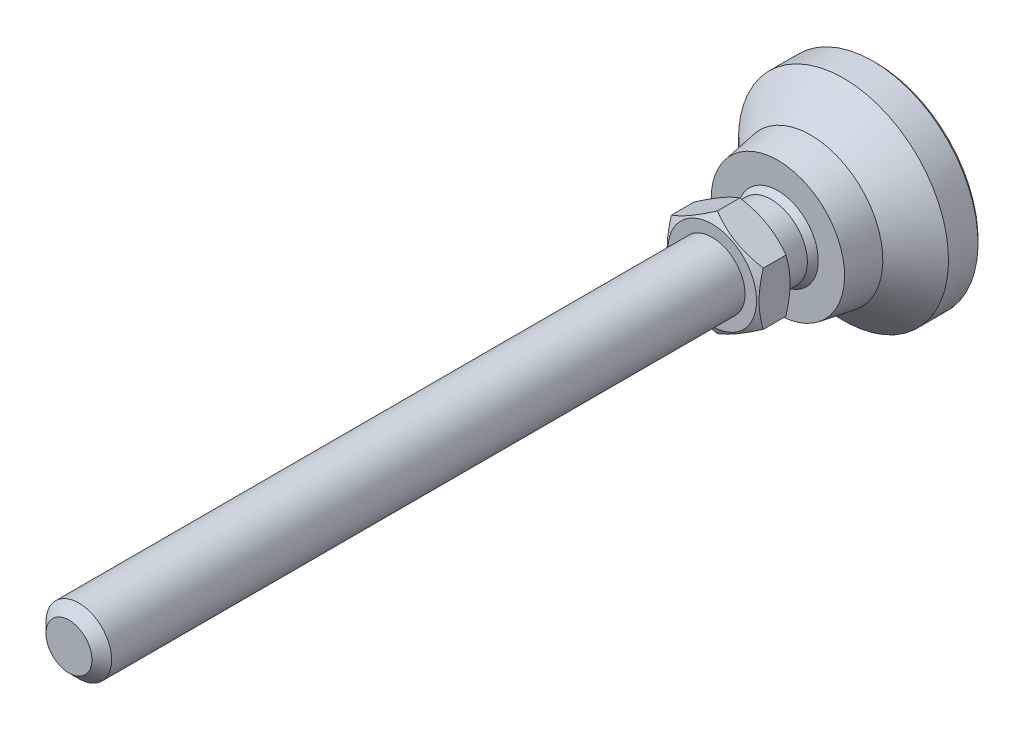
ISO-10303-21;
HEADER;
FILE_DESCRIPTION(('STEP AP214'),'2;1');
FILE_NAME('part.step','',(''),(''),'','','');
FILE_SCHEMA(('AUTOMOTIVE_DESIGN { 1 0 10303 214 1 1 1 1 }'));
ENDSEC;
DATA;
#1=APPLICATION_CONTEXT('core data for automotive mechanical design processes');
#2=APPLICATION_PROTOCOL_DEFINITION('international standard','automotive_design',2000,#1);
#3=PRODUCT_CONTEXT('',#1,'mechanical');
#4=PRODUCT('Part','Part','',(#3));
#5=PRODUCT_RELATED_PRODUCT_CATEGORY('part','',(#4));
#6=PRODUCT_DEFINITION_FORMATION('','',#4);
#7=PRODUCT_DEFINITION_CONTEXT('part definition',#1,'design');
#8=PRODUCT_DEFINITION('design','',#6,#7);
#9=PRODUCT_DEFINITION_SHAPE('','',#8);
#10=(LENGTH_UNIT() NAMED_UNIT(*) SI_UNIT(.MILLI.,.METRE.));
#11=(NAMED_UNIT(*) PLANE_ANGLE_UNIT() SI_UNIT($,.RADIAN.));
#12=(NAMED_UNIT(*) SI_UNIT($,.STERADIAN.) SOLID_ANGLE_UNIT());
#13=UNCERTAINTY_MEASURE_WITH_UNIT(LENGTH_MEASURE(1.E-05),#10,'distance_accuracy_value','');
#14=(GEOMETRIC_REPRESENTATION_CONTEXT(3) GLOBAL_UNCERTAINTY_ASSIGNED_CONTEXT((#13)) GLOBAL_UNIT_ASSIGNED_CONTEXT((#10,
#11,#12)) REPRESENTATION_CONTEXT('',''));
#15=CARTESIAN_POINT('',(0.,0.,0.));
#16=DIRECTION('',(0.,0.,1.));
#17=DIRECTION('',(1.,0.,0.));
#18=AXIS2_PLACEMENT_3D('',#15,#16,#17);
#19=CARTESIAN_POINT('',(0.,0.,0.));
#20=DIRECTION('',(0.,0.,-1.));
#21=DIRECTION('',(0.,1.,0.));
#22=AXIS2_PLACEMENT_3D('',#19,#20,#21);
#23=CYLINDRICAL_SURFACE('',#22,5.49999999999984);
#24=CARTESIAN_POINT('',(0.,0.,20.));
#25=DIRECTION('',(0.,0.,-1.));
#26=DIRECTION('',(0.,1.,0.));
#27=AXIS2_PLACEMENT_3D('',#24,#25,#26);
#28=CIRCLE('',#27,5.49999999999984);
#29=CARTESIAN_POINT('',(0.,5.49999999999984,20.));
#30=VERTEX_POINT('',#29);
#31=EDGE_CURVE('E112',#30,#30,#28,.T.);
#32=ORIENTED_EDGE('',*,*,#31,.T.);
#33=EDGE_LOOP('',(#32));
#34=FACE_BOUND('',#33,.T.);
#35=CARTESIAN_POINT('',(0.,0.,16.0000000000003));
#36=DIRECTION('',(0.,0.,1.));
#37=DIRECTION('',(0.,-1.,0.));
#38=AXIS2_PLACEMENT_3D('',#35,#36,#37);
#39=CIRCLE('',#38,5.49999999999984);
#40=CARTESIAN_POINT('',(-5.49999999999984,0.,16.0000000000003));
#41=VERTEX_POINT('',#40);
#42=EDGE_CURVE('E115',#41,#41,#39,.T.);
#43=ORIENTED_EDGE('',*,*,#42,.T.);
#44=EDGE_LOOP('',(#43));
#45=FACE_BOUND('',#44,.T.);
#46=ADVANCED_FACE('F14',(#34,#45),#23,.T.);
#47=CARTESIAN_POINT('',(0.,0.,11.6698729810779));
#48=DIRECTION('',(0.,0.,1.));
#49=DIRECTION('',(-1.,0.,0.));
#50=AXIS2_PLACEMENT_3D('',#47,#48,#49);
#51=SPHERICAL_SURFACE('',#50,7.);
#52=CARTESIAN_POINT('',(0.,0.,15.));
#53=DIRECTION('',(0.,0.,1.));
#54=DIRECTION('',(0.,-1.,0.));
#55=AXIS2_PLACEMENT_3D('',#52,#53,#54);
#56=CIRCLE('',#55,6.15713034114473);
#57=CARTESIAN_POINT('',(-6.15713034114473,0.,15.));
#58=VERTEX_POINT('',#57);
#59=EDGE_CURVE('E276',#58,#58,#56,.T.);
#60=CARTESIAN_POINT('',(-5.49999999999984,0.,16.0000000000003));
#61=CARTESIAN_POINT('',(-5.50771979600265,0.,15.9901945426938));
#62=CARTESIAN_POINT('',(-5.51541336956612,0.,15.9803684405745));
#63=CARTESIAN_POINT('',(-5.53074785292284,0.,15.9606752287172));
#64=CARTESIAN_POINT('',(-5.53838876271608,0.,15.9508081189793));
#65=CARTESIAN_POINT('',(-5.55361769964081,0.,15.9310331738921));
#66=CARTESIAN_POINT('',(-5.56120572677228,0.,15.9211253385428));
#67=CARTESIAN_POINT('',(-5.57632868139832,0.,15.9012692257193));
#68=CARTESIAN_POINT('',(-5.58386360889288,0.,15.8913209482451));
#69=CARTESIAN_POINT('',(-5.59888014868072,0.,15.871384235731));
#70=CARTESIAN_POINT('',(-5.60636176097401,0.,15.8613958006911));
#71=CARTESIAN_POINT('',(-5.62127145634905,0.,15.841379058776));
#72=CARTESIAN_POINT('',(-5.62869953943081,0.,15.8313507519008));
#73=CARTESIAN_POINT('',(-5.64350196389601,0.,15.81125455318));
#74=CARTESIAN_POINT('',(-5.65087630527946,0.,15.8011866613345));
#75=CARTESIAN_POINT('',(-5.66557103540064,0.,15.781011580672));
#76=CARTESIAN_POINT('',(-5.67289142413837,0.,15.770904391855));
#77=CARTESIAN_POINT('',(-5.68747803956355,0.,15.7506510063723));
#78=CARTESIAN_POINT('',(-5.69474426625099,0.,15.7405048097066));
#79=CARTESIAN_POINT('',(-5.70922234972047,0.,15.7201736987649));
#80=CARTESIAN_POINT('',(-5.7164342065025,0.,15.7099887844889));
#81=CARTESIAN_POINT('',(-5.7308033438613,0.,15.6895805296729));
#82=CARTESIAN_POINT('',(-5.73796062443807,0.,15.6793571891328));
#83=CARTESIAN_POINT('',(-5.75222040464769,0.,15.6588723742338));
#84=CARTESIAN_POINT('',(-5.75932290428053,0.,15.6486108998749));
#85=CARTESIAN_POINT('',(-5.77347291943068,0.,15.6280501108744));
#86=CARTESIAN_POINT('',(-5.78052043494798,0.,15.6177507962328));
#87=CARTESIAN_POINT('',(-5.79456028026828,0.,15.5971146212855));
#88=CARTESIAN_POINT('',(-5.80155261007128,0.,15.5867777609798));
#89=CARTESIAN_POINT('',(-5.81548188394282,0.,15.5660667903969));
#90=CARTESIAN_POINT('',(-5.82241882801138,0.,15.5556926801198));
#91=CARTESIAN_POINT('',(-5.83623713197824,0.,15.5349075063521));
#92=CARTESIAN_POINT('',(-5.84311849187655,0.,15.5244964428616));
#93=CARTESIAN_POINT('',(-5.85682543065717,0.,15.5036376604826));
#94=CARTESIAN_POINT('',(-5.86365100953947,0.,15.493189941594));
#95=CARTESIAN_POINT('',(-5.87724619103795,0.,15.4722581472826));
#96=CARTESIAN_POINT('',(-5.88401579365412,0.,15.4617740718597));
#97=CARTESIAN_POINT('',(-5.89749882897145,0.,15.4407698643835));
#98=CARTESIAN_POINT('',(-5.90421226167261,0.,15.4302497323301));
#99=CARTESIAN_POINT('',(-5.91758276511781,0.,15.4091737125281));
#100=CARTESIAN_POINT('',(-5.92423983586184,0.,15.3986178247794));
#101=CARTESIAN_POINT('',(-5.93749742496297,0.,15.3774705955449));
#102=CARTESIAN_POINT('',(-5.94409794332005,0.,15.366879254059));
#103=CARTESIAN_POINT('',(-5.95724223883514,0.,15.3456614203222));
#104=CARTESIAN_POINT('',(-5.96378601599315,0.,15.3350349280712));
#105=CARTESIAN_POINT('',(-5.9768166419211,0.,15.313747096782));
#106=CARTESIAN_POINT('',(-5.98330349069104,0.,15.3030857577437));
#107=CARTESIAN_POINT('',(-5.99622007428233,0.,15.2817285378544));
#108=CARTESIAN_POINT('',(-6.00264980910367,0.,15.2710326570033));
#109=CARTESIAN_POINT('',(-6.015451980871,0.,15.2496066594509));
#110=CARTESIAN_POINT('',(-6.02182441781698,0.,15.2388765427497));
#111=CARTESIAN_POINT('',(-6.034511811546,0.,15.217382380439));
#112=CARTESIAN_POINT('',(-6.04082676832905,0.,15.2066183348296));
#113=CARTESIAN_POINT('',(-6.05339902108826,0.,15.1850566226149));
#114=CARTESIAN_POINT('',(-6.05965631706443,0.,15.1742589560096));
#115=CARTESIAN_POINT('',(-6.07211306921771,0.,15.1526303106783));
#116=CARTESIAN_POINT('',(-6.07831252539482,0.,15.1417993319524));
#117=CARTESIAN_POINT('',(-6.09065342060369,0.,15.1201043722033));
#118=CARTESIAN_POINT('',(-6.09679485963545,0.,15.1092403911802));
#119=CARTESIAN_POINT('',(-6.10901954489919,0.,15.0874797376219));
#120=CARTESIAN_POINT('',(-6.11510279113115,0.,15.0765830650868));
#121=CARTESIAN_POINT('',(-6.12721091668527,0.,15.054757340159));
#122=CARTESIAN_POINT('',(-6.13323579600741,0.,15.0438282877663));
#123=CARTESIAN_POINT('',(-6.14522701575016,0.,15.0219381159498));
#124=CARTESIAN_POINT('',(-6.15119335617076,0.,15.010976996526));
#125=CARTESIAN_POINT('',(-6.15713034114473,0.,15.));
#126=B_SPLINE_CURVE_WITH_KNOTS('',3,(#60,#61,#62,#63,#64,#65,#66,#67,#68,#69,#70,#71,#72,#73,
#74,#75,#76,#77,#78,#79,#80,#81,#82,#83,#84,#85,#86,#87,#88,#89,#90,#91,#92,#93,#94,#95,#96,#97,
#98,#99,#100,#101,#102,#103,#104,#105,#106,#107,#108,#109,#110,#111,#112,#113,#114,#115,#116,
#117,#118,#119,#120,#121,#122,#123,#124,#125),.UNSPECIFIED.,.F.,.F.,(4,2,2,2,2,2,2,2,2,2,2,2,2,
2,2,2,2,2,2,2,2,2,2,2,2,2,2,2,2,2,2,2,4),(0.,0.0374389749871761,0.0748779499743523,
0.112316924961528,0.149755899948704,0.18719487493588,0.224633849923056,0.26207282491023,
0.299511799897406,0.336950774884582,0.374389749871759,0.411828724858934,0.449267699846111,
0.486706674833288,0.524145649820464,0.56158462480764,0.599023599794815,0.636462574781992,
0.673901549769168,0.711340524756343,0.74877949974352,0.786218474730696,0.823657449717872,
0.861096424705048,0.898535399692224,0.9359743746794,0.973413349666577,1.01085232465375,
1.04829129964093,1.0857302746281,1.12316924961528,1.16060822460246,1.19804719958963),.UNSPECIFIED.);
#127=EDGE_CURVE('BSEAM243',#41,#58,#126,.T.);
#128=ORIENTED_EDGE('',*,*,#42,.F.);
#129=ORIENTED_EDGE('',*,*,#59,.T.);
#130=ORIENTED_EDGE('',*,*,#127,.T.);
#131=ORIENTED_EDGE('',*,*,#127,.F.);
#132=EDGE_LOOP('',(#128,#130,#129,#131));
#133=FACE_BOUND('',#132,.T.);
#134=ADVANCED_FACE('F243',(#133),#51,.T.);
#135=CARTESIAN_POINT('',(-15.5,0.,0.));
#136=DIRECTION('',(0.,0.,1.));
#137=DIRECTION('',(0.,-1.,0.));
#138=AXIS2_PLACEMENT_3D('',#135,#136,#137);
#139=PLANE('',#138);
#140=CARTESIAN_POINT('',(0.,0.,0.));
#141=DIRECTION('',(0.,0.,-1.));
#142=DIRECTION('',(0.,1.,0.));
#143=AXIS2_PLACEMENT_3D('',#140,#141,#142);
#144=CIRCLE('',#143,15.5);
#145=CARTESIAN_POINT('',(0.,15.5,0.));
#146=VERTEX_POINT('',#145);
#147=EDGE_CURVE('E85',#146,#146,#144,.T.);
#148=ORIENTED_EDGE('',*,*,#147,.T.);
#149=EDGE_LOOP('',(#148));
#150=FACE_BOUND('',#149,.T.);
#151=ADVANCED_FACE('F246',(#150),#139,.F.);
#152=CARTESIAN_POINT('',(0.,0.,0.500000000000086));
#153=DIRECTION('',(0.,0.,1.));
#154=DIRECTION('',(0.,-1.,0.));
#155=AXIS2_PLACEMENT_3D('',#152,#153,#154);
#156=CONICAL_SURFACE('',#155,16.,0.785398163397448);
#157=ORIENTED_EDGE('',*,*,#147,.F.);
#158=EDGE_LOOP('',(#157));
#159=FACE_BOUND('',#158,.T.);
#160=CARTESIAN_POINT('',(0.,0.,0.500000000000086));
#161=DIRECTION('',(0.,0.,-1.));
#162=DIRECTION('',(0.,1.,0.));
#163=AXIS2_PLACEMENT_3D('',#160,#161,#162);
#164=CIRCLE('',#163,16.);
#165=CARTESIAN_POINT('',(0.,16.,0.500000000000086));
#166=VERTEX_POINT('',#165);
#167=EDGE_CURVE('E88',#166,#166,#164,.T.);
#168=ORIENTED_EDGE('',*,*,#167,.T.);
#169=EDGE_LOOP('',(#168));
#170=FACE_BOUND('',#169,.T.);
#171=ADVANCED_FACE('F361',(#159,#170),#156,.T.);
#172=CARTESIAN_POINT('',(0.,0.,0.));
#173=DIRECTION('',(0.,0.,-1.));
#174=DIRECTION('',(0.,1.,0.));
#175=AXIS2_PLACEMENT_3D('',#172,#173,#174);
#176=CYLINDRICAL_SURFACE('',#175,16.);
#177=ORIENTED_EDGE('',*,*,#167,.F.);
#178=EDGE_LOOP('',(#177));
#179=FACE_BOUND('',#178,.T.);
#180=CARTESIAN_POINT('',(0.,0.,5.00000000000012));
#181=DIRECTION('',(0.,0.,-1.));
#182=DIRECTION('',(0.,1.,0.));
#183=AXIS2_PLACEMENT_3D('',#180,#181,#182);
#184=CIRCLE('',#183,16.);
#185=CARTESIAN_POINT('',(0.,16.,5.00000000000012));
#186=VERTEX_POINT('',#185);
#187=EDGE_CURVE('E105',#186,#186,#184,.T.);
#188=ORIENTED_EDGE('',*,*,#187,.T.);
#189=EDGE_LOOP('',(#188));
#190=FACE_BOUND('',#189,.T.);
#191=ADVANCED_FACE('F368',(#179,#190),#176,.T.);
#192=CARTESIAN_POINT('',(0.,0.,10.));
#193=DIRECTION('',(0.,0.,-1.));
#194=DIRECTION('',(0.,1.,0.));
#195=AXIS2_PLACEMENT_3D('',#192,#193,#194);
#196=CONICAL_SURFACE('',#195,11.,0.785398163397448);
#197=ORIENTED_EDGE('',*,*,#187,.F.);
#198=EDGE_LOOP('',(#197));
#199=FACE_BOUND('',#198,.T.);
#200=CARTESIAN_POINT('',(0.,0.,10.));
#201=DIRECTION('',(0.,0.,-1.));
#202=DIRECTION('',(0.,1.,0.));
#203=AXIS2_PLACEMENT_3D('',#200,#201,#202);
#204=CIRCLE('',#203,11.);
#205=CARTESIAN_POINT('',(0.,11.,10.));
#206=VERTEX_POINT('',#205);
#207=EDGE_CURVE('E108',#206,#206,#204,.T.);
#208=ORIENTED_EDGE('',*,*,#207,.T.);
#209=EDGE_LOOP('',(#208));
#210=FACE_BOUND('',#209,.T.);
#211=ADVANCED_FACE('F376',(#199,#210),#196,.T.);
#212=CARTESIAN_POINT('',(0.,0.,16.));
#213=DIRECTION('',(0.,0.,-1.));
#214=DIRECTION('',(0.,1.,0.));
#215=AXIS2_PLACEMENT_3D('',#212,#213,#214);
#216=CONICAL_SURFACE('',#215,10.,0.165148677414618);
#217=ORIENTED_EDGE('',*,*,#207,.F.);
#218=EDGE_LOOP('',(#217));
#219=FACE_BOUND('',#218,.T.);
#220=CARTESIAN_POINT('',(0.,0.,15.));
#221=DIRECTION('',(0.,0.,-1.));
#222=DIRECTION('',(0.,1.,0.));
#223=AXIS2_PLACEMENT_3D('',#220,#221,#222);
#224=CIRCLE('',#223,10.1666666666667);
#225=CARTESIAN_POINT('',(0.,10.1666666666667,15.));
#226=VERTEX_POINT('',#225);
#227=EDGE_CURVE('E93',#226,#226,#224,.T.);
#228=ORIENTED_EDGE('',*,*,#227,.T.);
#229=EDGE_LOOP('',(#228));
#230=FACE_BOUND('',#229,.T.);
#231=ADVANCED_FACE('F241',(#219,#230),#216,.T.);
#232=CARTESIAN_POINT('',(-10.1666666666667,0.,15.));
#233=DIRECTION('',(0.,0.,1.));
#234=DIRECTION('',(0.,-1.,0.));
#235=AXIS2_PLACEMENT_3D('',#232,#233,#234);
#236=PLANE('',#235);
#237=ORIENTED_EDGE('',*,*,#227,.F.);
#238=EDGE_LOOP('',(#237));
#239=FACE_BOUND('',#238,.T.);
#240=ORIENTED_EDGE('',*,*,#59,.F.);
#241=EDGE_LOOP('',(#240));
#242=FACE_BOUND('',#241,.T.);
#243=ADVANCED_FACE('F236',(#239,#242),#236,.T.);
#244=CARTESIAN_POINT('',(0.,-8.08290376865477,20.));
#245=DIRECTION('',(0.,0.,-1.));
#246=DIRECTION('',(0.,1.,0.));
#247=AXIS2_PLACEMENT_3D('',#244,#245,#246);
#248=PLANE('',#247);
#249=CARTESIAN_POINT('',(0.,0.,20.));
#250=DIRECTION('',(0.,0.,1.));
#251=DIRECTION('',(0.,-1.,0.));
#252=AXIS2_PLACEMENT_3D('',#249,#250,#251);
#253=CIRCLE('',#252,6.75);
#254=CARTESIAN_POINT('',(0.,-6.75,20.));
#255=VERTEX_POINT('',#254);
#256=EDGE_CURVE('E80',#255,#255,#253,.T.);
#257=ORIENTED_EDGE('',*,*,#256,.F.);
#258=EDGE_LOOP('',(#257));
#259=FACE_BOUND('',#258,.T.);
#260=ORIENTED_EDGE('',*,*,#31,.F.);
#261=EDGE_LOOP('',(#260));
#262=FACE_BOUND('',#261,.T.);
#263=ADVANCED_FACE('F240',(#259,#262),#248,.T.);
#264=CARTESIAN_POINT('',(0.,0.,20.));
#265=DIRECTION('',(0.,0.,1.));
#266=DIRECTION('',(0.,-1.,0.));
#267=AXIS2_PLACEMENT_3D('',#264,#265,#266);
#268=CONICAL_SURFACE('',#267,6.75,1.0471975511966);
#269=CARTESIAN_POINT('',(7.0002,-4.04133641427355,20.7696190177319));
#270=CARTESIAN_POINT('',(6.84633209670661,-4.13017208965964,20.7183374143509));
#271=CARTESIAN_POINT('',(6.69189049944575,-4.21933898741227,20.669383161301));
#272=CARTESIAN_POINT('',(6.38175307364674,-4.3983969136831,20.5767703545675));
#273=CARTESIAN_POINT('',(6.22605673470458,-4.4882882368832,20.5331140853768));
#274=CARTESIAN_POINT('',(5.75647483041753,-4.7594014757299,20.4109491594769));
#275=CARTESIAN_POINT('',(5.4407356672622,-4.94169356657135,20.3414631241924));
#276=CARTESIAN_POINT('',(4.96823775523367,-5.21449036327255,20.2599825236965));
#277=CARTESIAN_POINT('',(4.81289077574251,-5.30417998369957,20.2367710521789));
#278=CARTESIAN_POINT('',(4.50149488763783,-5.48396448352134,20.1978487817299));
#279=CARTESIAN_POINT('',(4.34544604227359,-5.57405932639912,20.1821373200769));
#280=CARTESIAN_POINT('',(4.03307732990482,-5.75440548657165,20.1586154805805));
#281=CARTESIAN_POINT('',(3.87675797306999,-5.84465650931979,20.1507961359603));
#282=CARTESIAN_POINT('',(3.56398349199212,-6.02523694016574,20.1432178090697));
#283=CARTESIAN_POINT('',(3.40752837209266,-6.11556634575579,20.1434585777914));
#284=CARTESIAN_POINT('',(2.97889312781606,-6.36303901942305,20.155197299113));
#285=CARTESIAN_POINT('',(2.7068533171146,-6.52010127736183,20.1749033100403));
#286=CARTESIAN_POINT('',(2.1645805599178,-6.8331825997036,20.2373910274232));
#287=CARTESIAN_POINT('',(1.89434952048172,-6.98920056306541,20.2801940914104));
#288=CARTESIAN_POINT('',(1.35098545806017,-7.30291195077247,20.3871892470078));
#289=CARTESIAN_POINT('',(1.07792099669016,-7.46056579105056,20.4518346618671));
#290=CARTESIAN_POINT('',(0.535864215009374,-7.77352241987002,20.5985536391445));
#291=CARTESIAN_POINT('',(0.266864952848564,-7.92882921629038,20.680592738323));
#292=CARTESIAN_POINT('',(-0.000199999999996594,-8.08301923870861,20.7696190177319));
#293=B_SPLINE_CURVE_WITH_KNOTS('',3,(#269,#270,#271,#272,#273,#274,#275,#276,#277,#278,#279,
#280,#281,#282,#283,#284,#285,#286,#287,#288,#289,#290,#291,#292),.UNSPECIFIED.,.F.,.F.,(4,2,2,
2,2,2,2,2,2,2,2,4),(0.,0.554727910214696,1.10969417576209,2.2219327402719,2.76443041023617,
3.30688013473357,3.8487128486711,4.39052882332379,5.33376515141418,6.27787517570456,
7.24292418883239,8.20607866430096),.UNSPECIFIED.);
#294=CARTESIAN_POINT('',(7.,-4.04145188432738,20.7695523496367));
#295=VERTEX_POINT('',#294);
#296=CARTESIAN_POINT('',(0.,-8.08290376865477,20.7695523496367));
#297=VERTEX_POINT('',#296);
#298=EDGE_CURVE('E33',#295,#297,#293,.T.);
#299=ORIENTED_EDGE('',*,*,#298,.T.);
#300=CARTESIAN_POINT('',(0.000200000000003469,-8.0830192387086,20.7696190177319));
#301=CARTESIAN_POINT('',(-0.153667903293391,-7.99418356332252,20.7183374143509));
#302=CARTESIAN_POINT('',(-0.30810950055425,-7.90501666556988,20.669383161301));
#303=CARTESIAN_POINT('',(-0.618246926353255,-7.72595873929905,20.5767703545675));
#304=CARTESIAN_POINT('',(-0.773943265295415,-7.63606741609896,20.5331140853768));
#305=CARTESIAN_POINT('',(-1.24352516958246,-7.36495417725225,20.4109491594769));
#306=CARTESIAN_POINT('',(-1.5592643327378,-7.18266208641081,20.3414631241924));
#307=CARTESIAN_POINT('',(-2.03176224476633,-6.90986528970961,20.2599825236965));
#308=CARTESIAN_POINT('',(-2.18710922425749,-6.82017566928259,20.2367710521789));
#309=CARTESIAN_POINT('',(-2.49850511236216,-6.64039116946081,20.1978487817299));
#310=CARTESIAN_POINT('',(-2.65455395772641,-6.55029632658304,20.1821373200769));
#311=CARTESIAN_POINT('',(-2.96692267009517,-6.36995016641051,20.1586154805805));
#312=CARTESIAN_POINT('',(-3.12324202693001,-6.27969914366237,20.1507961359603));
#313=CARTESIAN_POINT('',(-3.43601650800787,-6.09911871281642,20.1432178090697));
#314=CARTESIAN_POINT('',(-3.59247162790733,-6.00878930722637,20.1434585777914));
#315=CARTESIAN_POINT('',(-4.02110687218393,-5.76131663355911,20.155197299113));
#316=CARTESIAN_POINT('',(-4.2931466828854,-5.60425437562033,20.1749033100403));
#317=CARTESIAN_POINT('',(-4.8354194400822,-5.29117305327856,20.2373910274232));
#318=CARTESIAN_POINT('',(-5.10565047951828,-5.13515508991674,20.2801940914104));
#319=CARTESIAN_POINT('',(-5.64901454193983,-4.82144370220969,20.3871892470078));
#320=CARTESIAN_POINT('',(-5.92207900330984,-4.6637898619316,20.4518346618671));
#321=CARTESIAN_POINT('',(-6.46413578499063,-4.35083323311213,20.5985536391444));
#322=CARTESIAN_POINT('',(-6.73313504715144,-4.19552643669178,20.680592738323));
#323=CARTESIAN_POINT('',(-7.0002,-4.04133641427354,20.7696190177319));
#324=B_SPLINE_CURVE_WITH_KNOTS('',3,(#300,#301,#302,#303,#304,#305,#306,#307,#308,#309,#310,
#311,#312,#313,#314,#315,#316,#317,#318,#319,#320,#321,#322,#323),.UNSPECIFIED.,.F.,.F.,(4,2,2,
2,2,2,2,2,2,2,2,4),(0.,0.554727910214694,1.10969417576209,2.2219327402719,2.76443041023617,
3.30688013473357,3.8487128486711,4.39052882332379,5.33376515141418,6.27787517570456,
7.2429241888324,8.20607866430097),.UNSPECIFIED.);
#325=CARTESIAN_POINT('',(-7.,-4.04145188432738,20.7695523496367));
#326=VERTEX_POINT('',#325);
#327=EDGE_CURVE('E9',#297,#326,#324,.T.);
#328=ORIENTED_EDGE('',*,*,#327,.T.);
#329=CARTESIAN_POINT('',(-7.,10.8702835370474,23.5675371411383));
#330=CARTESIAN_POINT('',(-7.,10.5644253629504,23.4191104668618));
#331=CARTESIAN_POINT('',(-7.,10.2578666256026,23.2721027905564));
#332=CARTESIAN_POINT('',(-7.,9.64297550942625,22.9817232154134));
#333=CARTESIAN_POINT('',(-7.,9.33464286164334,22.8383518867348));
#334=CARTESIAN_POINT('',(-7.,8.7142497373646,22.5553245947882));
#335=CARTESIAN_POINT('',(-7.,8.40217811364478,22.4156929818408));
#336=CARTESIAN_POINT('',(-7.,7.77555786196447,22.1421246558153));
#337=CARTESIAN_POINT('',(-7.,7.46100935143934,22.0081876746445));
#338=CARTESIAN_POINT('',(-7.,6.81872733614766,21.743301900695));
#339=CARTESIAN_POINT('',(-7.,6.49089596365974,21.6125891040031));
#340=CARTESIAN_POINT('',(-7.,5.83140395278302,21.3610213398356));
#341=CARTESIAN_POINT('',(-7.,5.49974289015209,21.240167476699));
#342=CARTESIAN_POINT('',(-7.,4.83267592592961,21.0114799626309));
#343=CARTESIAN_POINT('',(-7.,4.49727911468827,20.9036200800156));
#344=CARTESIAN_POINT('',(-7.,3.82168635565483,20.7043706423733));
#345=CARTESIAN_POINT('',(-7.,3.48149195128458,20.6129759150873));
#346=CARTESIAN_POINT('',(-7.,2.7979450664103,20.4515260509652));
#347=CARTESIAN_POINT('',(-7.,2.45462079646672,20.3813546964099));
#348=CARTESIAN_POINT('',(-7.,1.93649600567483,20.295045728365));
#349=CARTESIAN_POINT('',(-7.,1.7632518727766,20.2694329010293));
#350=CARTESIAN_POINT('',(-7.,1.41589837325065,20.2250254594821));
#351=CARTESIAN_POINT('',(-7.,1.24178909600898,20.2062301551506));
#352=CARTESIAN_POINT('',(-7.,0.895218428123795,20.17606851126));
#353=CARTESIAN_POINT('',(-7.,0.722765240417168,20.1646082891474));
#354=CARTESIAN_POINT('',(-7.,0.377528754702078,20.1489915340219));
#355=CARTESIAN_POINT('',(-7.,0.204745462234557,20.1448348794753));
#356=CARTESIAN_POINT('',(-7.,-0.140842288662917,20.1439244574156));
#357=CARTESIAN_POINT('',(-7.,-0.313646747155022,20.1471707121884));
#358=CARTESIAN_POINT('',(-7.,-0.658964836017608,20.1609865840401));
#359=CARTESIAN_POINT('',(-7.,-0.831478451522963,20.1715565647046));
#360=CARTESIAN_POINT('',(-7.,-1.24563895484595,20.205499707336));
#361=CARTESIAN_POINT('',(-7.,-1.48700907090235,20.2323231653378));
#362=CARTESIAN_POINT('',(-7.,-1.96795604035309,20.2988467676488));
#363=CARTESIAN_POINT('',(-7.,-2.20753264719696,20.3385486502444));
#364=CARTESIAN_POINT('',(-7.,-2.9232991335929,20.4748665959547));
#365=CARTESIAN_POINT('',(-7.,-3.39625884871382,20.5886701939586));
#366=CARTESIAN_POINT('',(-7.,-4.10348368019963,20.7859997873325));
#367=CARTESIAN_POINT('',(-7.,-4.34141737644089,20.8571337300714));
#368=CARTESIAN_POINT('',(-7.,-4.81497377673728,21.0067861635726));
#369=CARTESIAN_POINT('',(-7.,-5.05059646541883,21.0853047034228));
#370=CARTESIAN_POINT('',(-7.,-5.51960507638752,21.2484668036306));
#371=CARTESIAN_POINT('',(-7.,-5.75299170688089,21.3331083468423));
#372=CARTESIAN_POINT('',(-7.,-6.21783145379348,21.5075209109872));
#373=CARTESIAN_POINT('',(-7.,-6.4492845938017,21.5972918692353));
#374=CARTESIAN_POINT('',(-7.,-6.9992643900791,21.8165019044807));
#375=CARTESIAN_POINT('',(-7.,-7.31700619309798,21.9479065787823));
#376=CARTESIAN_POINT('',(-7.,-7.949756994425,22.217157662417));
#377=CARTESIAN_POINT('',(-7.,-8.26476581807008,22.35500447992));
#378=CARTESIAN_POINT('',(-7.,-8.89255914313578,22.6358336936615));
#379=CARTESIAN_POINT('',(-7.,-9.2053431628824,22.7788171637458));
#380=CARTESIAN_POINT('',(-7.,-9.82900890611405,23.068881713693));
#381=CARTESIAN_POINT('',(-7.,-10.1398905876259,23.215962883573));
#382=CARTESIAN_POINT('',(-7.,-10.7604003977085,23.513606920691));
#383=CARTESIAN_POINT('',(-7.,-11.0700267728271,23.6641734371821));
#384=CARTESIAN_POINT('',(-7.,-11.6879384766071,23.9680360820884));
#385=CARTESIAN_POINT('',(-7.,-11.9962237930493,24.1213322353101));
#386=CARTESIAN_POINT('',(-7.,-12.9193064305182,24.5845405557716));
#387=CARTESIAN_POINT('',(-7.,-13.5324166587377,24.8978142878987));
#388=CARTESIAN_POINT('',(-7.,-14.7033521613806,25.5037261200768));
#389=CARTESIAN_POINT('',(-7.,-15.2614434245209,25.7958525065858));
#390=CARTESIAN_POINT('',(-7.,-16.375558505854,26.3840679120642));
#391=CARTESIAN_POINT('',(-7.,-16.9315822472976,26.6801570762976));
#392=CARTESIAN_POINT('',(-7.,-18.0406029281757,27.2745892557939));
#393=CARTESIAN_POINT('',(-7.,-18.5936039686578,27.5729246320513));
#394=CARTESIAN_POINT('',(-7.,-19.6982866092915,28.171955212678));
#395=CARTESIAN_POINT('',(-7.,-20.2499682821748,28.4726502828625));
#396=CARTESIAN_POINT('',(-7.,-20.8011656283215,28.7742246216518));
#397=B_SPLINE_CURVE_WITH_KNOTS('',3,(#329,#330,#331,#332,#333,#334,#335,#336,#337,#338,#339,
#340,#341,#342,#343,#344,#345,#346,#347,#348,#349,#350,#351,#352,#353,#354,#355,#356,#357,#358,
#359,#360,#361,#362,#363,#364,#365,#366,#367,#368,#369,#370,#371,#372,#373,#374,#375,#376,#377,
#378,#379,#380,#381,#382,#383,#384,#385,#386,#387,#388,#389,#390,#391,#392,#393,#394,#395,#396),
.UNSPECIFIED.,.F.,.F.,(4,2,2,2,2,2,2,2,2,2,2,2,2,2,2,2,2,2,2,2,2,2,2,2,2,2,2,2,2,2,2,2,2,4),(0.,
1.01992281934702,2.04000458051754,3.06561543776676,4.09117795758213,5.14984345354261,
6.20862737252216,7.26523671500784,8.3215135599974,9.37189697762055,9.89716564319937,
10.4223811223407,10.9407322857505,11.4590748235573,11.9774189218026,12.4957887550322,
13.2239455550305,13.9522006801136,15.4095112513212,16.154467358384,16.8994284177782,
17.6441451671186,18.3888528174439,19.4202812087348,20.4517750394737,21.4834857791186,
22.5152192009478,23.5480866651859,24.5809635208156,26.6464299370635,28.5361836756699,
30.4260068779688,32.3110279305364,34.1959425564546),.UNSPECIFIED.);
#398=CARTESIAN_POINT('',(-7.,4.04145188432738,20.7695523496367));
#399=VERTEX_POINT('',#398);
#400=EDGE_CURVE('E72',#326,#399,#397,.F.);
#401=ORIENTED_EDGE('',*,*,#400,.T.);
#402=CARTESIAN_POINT('',(-7.0002,4.04133641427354,20.7696190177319));
#403=CARTESIAN_POINT('',(-6.84633209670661,4.13017208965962,20.7183374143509));
#404=CARTESIAN_POINT('',(-6.69189049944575,4.21933898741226,20.669383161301));
#405=CARTESIAN_POINT('',(-6.38175307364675,4.39839691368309,20.5767703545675));
#406=CARTESIAN_POINT('',(-6.22605673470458,4.48828823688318,20.5331140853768));
#407=CARTESIAN_POINT('',(-5.75647483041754,4.75940147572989,20.4109491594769));
#408=CARTESIAN_POINT('',(-5.4407356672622,4.94169356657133,20.3414631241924));
#409=CARTESIAN_POINT('',(-4.96823775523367,5.21449036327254,20.2599825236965));
#410=CARTESIAN_POINT('',(-4.81289077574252,5.30417998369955,20.2367710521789));
#411=CARTESIAN_POINT('',(-4.50149488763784,5.48396448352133,20.1978487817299));
#412=CARTESIAN_POINT('',(-4.34544604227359,5.57405932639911,20.1821373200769));
#413=CARTESIAN_POINT('',(-4.03307732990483,5.75440548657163,20.1586154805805));
#414=CARTESIAN_POINT('',(-3.87675797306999,5.84465650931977,20.1507961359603));
#415=CARTESIAN_POINT('',(-3.56398349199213,6.02523694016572,20.1432178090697));
#416=CARTESIAN_POINT('',(-3.40752837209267,6.11556634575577,20.1434585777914));
#417=CARTESIAN_POINT('',(-2.97889312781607,6.36303901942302,20.155197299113));
#418=CARTESIAN_POINT('',(-2.7068533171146,6.52010127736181,20.1749033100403));
#419=CARTESIAN_POINT('',(-2.16458055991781,6.83318259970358,20.2373910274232));
#420=CARTESIAN_POINT('',(-1.89434952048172,6.9892005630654,20.2801940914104));
#421=CARTESIAN_POINT('',(-1.35098545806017,7.30291195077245,20.3871892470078));
#422=CARTESIAN_POINT('',(-1.07792099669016,7.46056579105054,20.4518346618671));
#423=CARTESIAN_POINT('',(-0.535864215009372,7.77352241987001,20.5985536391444));
#424=CARTESIAN_POINT('',(-0.266864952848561,7.92882921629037,20.680592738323));
#425=CARTESIAN_POINT('',(0.000199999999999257,8.0830192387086,20.7696190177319));
#426=B_SPLINE_CURVE_WITH_KNOTS('',3,(#402,#403,#404,#405,#406,#407,#408,#409,#410,#411,#412,
#413,#414,#415,#416,#417,#418,#419,#420,#421,#422,#423,#424,#425),.UNSPECIFIED.,.F.,.F.,(4,2,2,
2,2,2,2,2,2,2,2,4),(0.,0.554727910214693,1.10969417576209,2.2219327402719,2.76443041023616,
3.30688013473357,3.84871284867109,4.39052882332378,5.33376515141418,6.27787517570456,
7.2429241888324,8.20607866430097),.UNSPECIFIED.);
#427=CARTESIAN_POINT('',(0.,8.08290376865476,20.7695523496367));
#428=VERTEX_POINT('',#427);
#429=EDGE_CURVE('E79',#399,#428,#426,.T.);
#430=ORIENTED_EDGE('',*,*,#429,.T.);
#431=CARTESIAN_POINT('',(-0.000200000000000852,8.0830192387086,20.7696190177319));
#432=CARTESIAN_POINT('',(0.15366790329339,7.99418356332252,20.7183374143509));
#433=CARTESIAN_POINT('',(0.308109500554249,7.90501666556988,20.669383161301));
#434=CARTESIAN_POINT('',(0.618246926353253,7.72595873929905,20.5767703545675));
#435=CARTESIAN_POINT('',(0.773943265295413,7.63606741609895,20.5331140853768));
#436=CARTESIAN_POINT('',(1.24352516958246,7.36495417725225,20.4109491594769));
#437=CARTESIAN_POINT('',(1.5592643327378,7.18266208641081,20.3414631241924));
#438=CARTESIAN_POINT('',(2.03176224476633,6.9098652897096,20.2599825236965));
#439=CARTESIAN_POINT('',(2.18710922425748,6.82017566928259,20.2367710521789));
#440=CARTESIAN_POINT('',(2.49850511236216,6.64039116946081,20.1978487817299));
#441=CARTESIAN_POINT('',(2.65455395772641,6.55029632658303,20.1821373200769));
#442=CARTESIAN_POINT('',(2.96692267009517,6.36995016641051,20.1586154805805));
#443=CARTESIAN_POINT('',(3.12324202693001,6.27969914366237,20.1507961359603));
#444=CARTESIAN_POINT('',(3.43601650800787,6.09911871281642,20.1432178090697));
#445=CARTESIAN_POINT('',(3.59247162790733,6.00878930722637,20.1434585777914));
#446=CARTESIAN_POINT('',(4.02110687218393,5.76131663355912,20.155197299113));
#447=CARTESIAN_POINT('',(4.2931466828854,5.60425437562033,20.1749033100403));
#448=CARTESIAN_POINT('',(4.83541944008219,5.29117305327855,20.2373910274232));
#449=CARTESIAN_POINT('',(5.10565047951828,5.13515508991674,20.2801940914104));
#450=CARTESIAN_POINT('',(5.64901454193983,4.82144370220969,20.3871892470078));
#451=CARTESIAN_POINT('',(5.92207900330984,4.66378986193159,20.4518346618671));
#452=CARTESIAN_POINT('',(6.46413578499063,4.35083323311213,20.5985536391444));
#453=CARTESIAN_POINT('',(6.73313504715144,4.19552643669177,20.680592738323));
#454=CARTESIAN_POINT('',(7.0002,4.04133641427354,20.7696190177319));
#455=B_SPLINE_CURVE_WITH_KNOTS('',3,(#431,#432,#433,#434,#435,#436,#437,#438,#439,#440,#441,
#442,#443,#444,#445,#446,#447,#448,#449,#450,#451,#452,#453,#454),.UNSPECIFIED.,.F.,.F.,(4,2,2,
2,2,2,2,2,2,2,2,4),(0.,0.554727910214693,1.10969417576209,2.2219327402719,2.76443041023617,
3.30688013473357,3.8487128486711,4.39052882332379,5.33376515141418,6.27787517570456,
7.2429241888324,8.20607866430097),.UNSPECIFIED.);
#456=CARTESIAN_POINT('',(7.,4.04145188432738,20.7695523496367));
#457=VERTEX_POINT('',#456);
#458=EDGE_CURVE('E194',#428,#457,#455,.T.);
#459=ORIENTED_EDGE('',*,*,#458,.T.);
#460=CARTESIAN_POINT('',(7.,10.8702835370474,23.5675371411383));
#461=CARTESIAN_POINT('',(7.,10.5644253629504,23.4191104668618));
#462=CARTESIAN_POINT('',(7.,10.2578666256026,23.2721027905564));
#463=CARTESIAN_POINT('',(7.,9.64297550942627,22.9817232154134));
#464=CARTESIAN_POINT('',(7.,9.33464286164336,22.8383518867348));
#465=CARTESIAN_POINT('',(7.,8.71424973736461,22.5553245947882));
#466=CARTESIAN_POINT('',(7.,8.40217811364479,22.4156929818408));
#467=CARTESIAN_POINT('',(7.,7.77555786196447,22.1421246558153));
#468=CARTESIAN_POINT('',(7.,7.46100935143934,22.0081876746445));
#469=CARTESIAN_POINT('',(7.,6.81872733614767,21.743301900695));
#470=CARTESIAN_POINT('',(7.,6.49089596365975,21.6125891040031));
#471=CARTESIAN_POINT('',(7.,5.83140395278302,21.3610213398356));
#472=CARTESIAN_POINT('',(7.,5.4997428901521,21.240167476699));
#473=CARTESIAN_POINT('',(7.,4.83267592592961,21.0114799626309));
#474=CARTESIAN_POINT('',(7.,4.49727911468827,20.9036200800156));
#475=CARTESIAN_POINT('',(7.,3.82168635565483,20.7043706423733));
#476=CARTESIAN_POINT('',(7.,3.48149195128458,20.6129759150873));
#477=CARTESIAN_POINT('',(7.,2.7979450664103,20.4515260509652));
#478=CARTESIAN_POINT('',(7.,2.45462079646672,20.3813546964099));
#479=CARTESIAN_POINT('',(7.,1.93649600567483,20.295045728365));
#480=CARTESIAN_POINT('',(7.,1.7632518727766,20.2694329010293));
#481=CARTESIAN_POINT('',(7.,1.41589837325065,20.2250254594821));
#482=CARTESIAN_POINT('',(7.,1.24178909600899,20.2062301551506));
#483=CARTESIAN_POINT('',(7.,0.895218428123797,20.17606851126));
#484=CARTESIAN_POINT('',(7.,0.72276524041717,20.1646082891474));
#485=CARTESIAN_POINT('',(7.,0.37752875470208,20.1489915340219));
#486=CARTESIAN_POINT('',(7.,0.204745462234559,20.1448348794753));
#487=CARTESIAN_POINT('',(7.,-0.140842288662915,20.1439244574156));
#488=CARTESIAN_POINT('',(7.,-0.31364674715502,20.1471707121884));
#489=CARTESIAN_POINT('',(7.,-0.658964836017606,20.1609865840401));
#490=CARTESIAN_POINT('',(7.,-0.831478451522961,20.1715565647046));
#491=CARTESIAN_POINT('',(7.,-1.24563895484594,20.205499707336));
#492=CARTESIAN_POINT('',(7.,-1.48700907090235,20.2323231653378));
#493=CARTESIAN_POINT('',(7.,-1.96795604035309,20.2988467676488));
#494=CARTESIAN_POINT('',(7.,-2.20753264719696,20.3385486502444));
#495=CARTESIAN_POINT('',(7.,-2.9232991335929,20.4748665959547));
#496=CARTESIAN_POINT('',(7.,-3.39625884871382,20.5886701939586));
#497=CARTESIAN_POINT('',(7.,-4.10348368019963,20.7859997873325));
#498=CARTESIAN_POINT('',(7.,-4.3414173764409,20.8571337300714));
#499=CARTESIAN_POINT('',(7.,-4.81497377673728,21.0067861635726));
#500=CARTESIAN_POINT('',(7.,-5.05059646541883,21.0853047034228));
#501=CARTESIAN_POINT('',(7.,-5.51960507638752,21.2484668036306));
#502=CARTESIAN_POINT('',(7.,-5.75299170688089,21.3331083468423));
#503=CARTESIAN_POINT('',(7.,-6.21783145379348,21.5075209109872));
#504=CARTESIAN_POINT('',(7.,-6.4492845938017,21.5972918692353));
#505=CARTESIAN_POINT('',(7.,-6.9992643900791,21.8165019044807));
#506=CARTESIAN_POINT('',(7.,-7.31700619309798,21.9479065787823));
#507=CARTESIAN_POINT('',(7.,-7.949756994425,22.217157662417));
#508=CARTESIAN_POINT('',(7.,-8.26476581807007,22.35500447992));
#509=CARTESIAN_POINT('',(7.,-8.89255914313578,22.6358336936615));
#510=CARTESIAN_POINT('',(7.,-9.20534316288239,22.7788171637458));
#511=CARTESIAN_POINT('',(7.,-9.82900890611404,23.068881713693));
#512=CARTESIAN_POINT('',(7.,-10.1398905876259,23.215962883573));
#513=CARTESIAN_POINT('',(7.,-10.7604003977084,23.513606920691));
#514=CARTESIAN_POINT('',(7.,-11.0700267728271,23.6641734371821));
#515=CARTESIAN_POINT('',(7.,-11.687938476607,23.9680360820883));
#516=CARTESIAN_POINT('',(7.,-11.9962237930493,24.1213322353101));
#517=CARTESIAN_POINT('',(7.,-12.9193064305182,24.5845405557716));
#518=CARTESIAN_POINT('',(7.,-13.5324166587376,24.8978142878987));
#519=CARTESIAN_POINT('',(7.,-14.7033521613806,25.5037261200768));
#520=CARTESIAN_POINT('',(7.,-15.2614434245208,25.7958525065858));
#521=CARTESIAN_POINT('',(7.,-16.375558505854,26.3840679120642));
#522=CARTESIAN_POINT('',(7.,-16.9315822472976,26.6801570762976));
#523=CARTESIAN_POINT('',(7.,-18.0406029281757,27.2745892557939));
#524=CARTESIAN_POINT('',(7.,-18.5936039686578,27.5729246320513));
#525=CARTESIAN_POINT('',(7.,-19.6982866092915,28.171955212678));
#526=CARTESIAN_POINT('',(7.,-20.2499682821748,28.4726502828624));
#527=CARTESIAN_POINT('',(7.,-20.8011656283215,28.7742246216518));
#528=B_SPLINE_CURVE_WITH_KNOTS('',3,(#460,#461,#462,#463,#464,#465,#466,#467,#468,#469,#470,
#471,#472,#473,#474,#475,#476,#477,#478,#479,#480,#481,#482,#483,#484,#485,#486,#487,#488,#489,
#490,#491,#492,#493,#494,#495,#496,#497,#498,#499,#500,#501,#502,#503,#504,#505,#506,#507,#508,
#509,#510,#511,#512,#513,#514,#515,#516,#517,#518,#519,#520,#521,#522,#523,#524,#525,#526,#527),
.UNSPECIFIED.,.F.,.F.,(4,2,2,2,2,2,2,2,2,2,2,2,2,2,2,2,2,2,2,2,2,2,2,2,2,2,2,2,2,2,2,2,2,4),(0.,
1.01992281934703,2.04000458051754,3.06561543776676,4.09117795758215,5.14984345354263,
6.20862737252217,7.26523671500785,8.32151355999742,9.37189697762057,9.89716564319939,
10.4223811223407,10.9407322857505,11.4590748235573,11.9774189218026,12.4957887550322,
13.2239455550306,13.9522006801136,15.4095112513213,16.154467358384,16.8994284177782,
17.6441451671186,18.388852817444,19.4202812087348,20.4517750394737,21.4834857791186,
22.5152192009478,23.5480866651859,24.5809635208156,26.6464299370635,28.5361836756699,
30.4260068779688,32.3110279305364,34.1959425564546),.UNSPECIFIED.);
#529=EDGE_CURVE('E187',#457,#295,#528,.T.);
#530=ORIENTED_EDGE('',*,*,#529,.T.);
#531=EDGE_LOOP('',(#299,#328,#401,#430,#459,#530));
#532=FACE_BOUND('',#531,.T.);
#533=ORIENTED_EDGE('',*,*,#256,.T.);
#534=EDGE_LOOP('',(#533));
#535=FACE_BOUND('',#534,.T.);
#536=ADVANCED_FACE('F70',(#532,#535),#268,.T.);
#537=CARTESIAN_POINT('',(0.,0.,123.));
#538=DIRECTION('',(0.,0.,-1.));
#539=DIRECTION('',(0.,1.,0.));
#540=AXIS2_PLACEMENT_3D('',#537,#538,#539);
#541=PLANE('',#540);
#542=CARTESIAN_POINT('',(0.,0.,123.));
#543=DIRECTION('',(0.,0.,-1.));
#544=DIRECTION('',(0.,1.,0.));
#545=AXIS2_PLACEMENT_3D('',#542,#543,#544);
#546=CIRCLE('',#545,3.5);
#547=CARTESIAN_POINT('',(0.,3.5,123.));
#548=VERTEX_POINT('',#547);
#549=EDGE_CURVE('E116',#548,#548,#546,.T.);
#550=ORIENTED_EDGE('',*,*,#549,.F.);
#551=EDGE_LOOP('',(#550));
#552=FACE_BOUND('',#551,.T.);
#553=ADVANCED_FACE('F253',(#552),#541,.F.);
#554=CARTESIAN_POINT('',(0.,0.,123.));
#555=DIRECTION('',(0.,0.,-1.));
#556=DIRECTION('',(0.,1.,0.));
#557=AXIS2_PLACEMENT_3D('',#554,#555,#556);
#558=CONICAL_SURFACE('',#557,3.5,0.785398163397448);
#559=CARTESIAN_POINT('',(0.,0.,121.5));
#560=DIRECTION('',(0.,0.,-1.));
#561=DIRECTION('',(0.,1.,0.));
#562=AXIS2_PLACEMENT_3D('',#559,#560,#561);
#563=CIRCLE('',#562,5.);
#564=CARTESIAN_POINT('',(0.,5.,121.5));
#565=VERTEX_POINT('',#564);
#566=EDGE_CURVE('E281',#565,#565,#563,.T.);
#567=ORIENTED_EDGE('',*,*,#566,.F.);
#568=EDGE_LOOP('',(#567));
#569=FACE_BOUND('',#568,.T.);
#570=ORIENTED_EDGE('',*,*,#549,.T.);
#571=EDGE_LOOP('',(#570));
#572=FACE_BOUND('',#571,.T.);
#573=ADVANCED_FACE('F255',(#569,#572),#558,.T.);
#574=CARTESIAN_POINT('',(0.,0.,0.));
#575=DIRECTION('',(0.,0.,-1.));
#576=DIRECTION('',(0.,1.,0.));
#577=AXIS2_PLACEMENT_3D('',#574,#575,#576);
#578=CYLINDRICAL_SURFACE('',#577,5.);
#579=CARTESIAN_POINT('',(0.,0.,25.));
#580=DIRECTION('',(0.,0.,-1.));
#581=DIRECTION('',(0.,1.,0.));
#582=AXIS2_PLACEMENT_3D('',#579,#580,#581);
#583=CIRCLE('',#582,5.);
#584=CARTESIAN_POINT('',(0.,5.,25.));
#585=VERTEX_POINT('',#584);
#586=EDGE_CURVE('E111',#585,#585,#583,.F.);
#587=ORIENTED_EDGE('',*,*,#586,.T.);
#588=EDGE_LOOP('',(#587));
#589=FACE_BOUND('',#588,.T.);
#590=ORIENTED_EDGE('',*,*,#566,.T.);
#591=EDGE_LOOP('',(#590));
#592=FACE_BOUND('',#591,.T.);
#593=ADVANCED_FACE('F133',(#589,#592),#578,.T.);
#594=CARTESIAN_POINT('',(-7.,12.1243556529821,25.));
#595=DIRECTION('',(0.,0.,-1.));
#596=DIRECTION('',(0.,1.,0.));
#597=AXIS2_PLACEMENT_3D('',#594,#595,#596);
#598=PLANE('',#597);
#599=CARTESIAN_POINT('',(0.,0.,25.));
#600=DIRECTION('',(0.,0.,1.));
#601=DIRECTION('',(0.,-1.,0.));
#602=AXIS2_PLACEMENT_3D('',#599,#600,#601);
#603=CIRCLE('',#602,6.75);
#604=CARTESIAN_POINT('',(0.,-6.75,25.));
#605=VERTEX_POINT('',#604);
#606=EDGE_CURVE('E204',#605,#605,#603,.T.);
#607=ORIENTED_EDGE('',*,*,#606,.T.);
#608=EDGE_LOOP('',(#607));
#609=FACE_BOUND('',#608,.T.);
#610=ORIENTED_EDGE('',*,*,#586,.F.);
#611=EDGE_LOOP('',(#610));
#612=FACE_BOUND('',#611,.T.);
#613=ADVANCED_FACE('F130',(#609,#612),#598,.F.);
#614=CARTESIAN_POINT('',(0.,0.,22.9973057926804));
#615=DIRECTION('',(0.,0.,-1.));
#616=DIRECTION('',(0.,1.,0.));
#617=AXIS2_PLACEMENT_3D('',#614,#615,#616);
#618=CONICAL_SURFACE('',#617,10.2187681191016,1.0471975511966);
#619=CARTESIAN_POINT('',(-0.000199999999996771,-8.08301923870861,24.2303809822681));
#620=CARTESIAN_POINT('',(0.153667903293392,-7.99418356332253,24.2816625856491));
#621=CARTESIAN_POINT('',(0.30810950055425,-7.9050166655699,24.330616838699));
#622=CARTESIAN_POINT('',(0.618246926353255,-7.72595873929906,24.4232296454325));
#623=CARTESIAN_POINT('',(0.773943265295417,-7.63606741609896,24.4668859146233));
#624=CARTESIAN_POINT('',(1.24352516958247,-7.36495417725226,24.5890508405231));
#625=CARTESIAN_POINT('',(1.5592643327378,-7.18266208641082,24.6585368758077));
#626=CARTESIAN_POINT('',(2.03176224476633,-6.90986528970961,24.7400174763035));
#627=CARTESIAN_POINT('',(2.18710922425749,-6.8201756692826,24.7632289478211));
#628=CARTESIAN_POINT('',(2.49850511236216,-6.64039116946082,24.8021512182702));
#629=CARTESIAN_POINT('',(2.65455395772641,-6.55029632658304,24.8178626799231));
#630=CARTESIAN_POINT('',(2.96692267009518,-6.36995016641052,24.8413845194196));
#631=CARTESIAN_POINT('',(3.12324202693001,-6.27969914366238,24.8492038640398));
#632=CARTESIAN_POINT('',(3.43601650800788,-6.09911871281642,24.8567821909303));
#633=CARTESIAN_POINT('',(3.59247162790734,-6.00878930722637,24.8565414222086));
#634=CARTESIAN_POINT('',(4.02110687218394,-5.76131663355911,24.844802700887));
#635=CARTESIAN_POINT('',(4.29314668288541,-5.60425437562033,24.8250966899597));
#636=CARTESIAN_POINT('',(4.8354194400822,-5.29117305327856,24.7626089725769));
#637=CARTESIAN_POINT('',(5.10565047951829,-5.13515508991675,24.7198059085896));
#638=CARTESIAN_POINT('',(5.64901454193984,-4.82144370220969,24.6128107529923));
#639=CARTESIAN_POINT('',(5.92207900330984,-4.6637898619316,24.548165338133));
#640=CARTESIAN_POINT('',(6.46413578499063,-4.35083323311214,24.4014463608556));
#641=CARTESIAN_POINT('',(6.73313504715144,-4.19552643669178,24.3194072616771));
#642=CARTESIAN_POINT('',(7.0002,-4.04133641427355,24.2303809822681));
#643=B_SPLINE_CURVE_WITH_KNOTS('',3,(#619,#620,#621,#622,#623,#624,#625,#626,#627,#628,#629,
#630,#631,#632,#633,#634,#635,#636,#637,#638,#639,#640,#641,#642),.UNSPECIFIED.,.F.,.F.,(4,2,2,
2,2,2,2,2,2,2,2,4),(0.,0.554727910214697,1.1096941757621,2.2219327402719,2.76443041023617,
3.30688013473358,3.8487128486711,4.3905288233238,5.3337651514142,6.27787517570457,
7.2429241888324,8.20607866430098),.UNSPECIFIED.);
#644=CARTESIAN_POINT('',(0.,-8.08290376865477,24.2304476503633));
#645=VERTEX_POINT('',#644);
#646=CARTESIAN_POINT('',(7.,-4.04145188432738,24.2304476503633));
#647=VERTEX_POINT('',#646);
#648=EDGE_CURVE('E171',#645,#647,#643,.T.);
#649=ORIENTED_EDGE('',*,*,#648,.T.);
#650=CARTESIAN_POINT('',(7.,10.8702835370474,21.4324628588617));
#651=CARTESIAN_POINT('',(7.,10.5644253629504,21.5808895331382));
#652=CARTESIAN_POINT('',(7.,10.2578666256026,21.7278972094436));
#653=CARTESIAN_POINT('',(7.,9.64297550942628,22.0182767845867));
#654=CARTESIAN_POINT('',(7.,9.33464286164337,22.1616481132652));
#655=CARTESIAN_POINT('',(7.,8.71424973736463,22.4446754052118));
#656=CARTESIAN_POINT('',(7.,8.4021781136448,22.5843070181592));
#657=CARTESIAN_POINT('',(7.,7.77555786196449,22.8578753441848));
#658=CARTESIAN_POINT('',(7.,7.46100935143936,22.9918123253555));
#659=CARTESIAN_POINT('',(7.,6.81872733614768,23.2566980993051));
#660=CARTESIAN_POINT('',(7.,6.49089596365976,23.387410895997));
#661=CARTESIAN_POINT('',(7.,5.83140395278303,23.6389786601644));
#662=CARTESIAN_POINT('',(7.,5.49974289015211,23.7598325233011));
#663=CARTESIAN_POINT('',(7.,4.83267592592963,23.9885200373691));
#664=CARTESIAN_POINT('',(7.,4.49727911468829,24.0963799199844));
#665=CARTESIAN_POINT('',(7.,3.82168635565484,24.2956293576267));
#666=CARTESIAN_POINT('',(7.,3.48149195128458,24.3870240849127));
#667=CARTESIAN_POINT('',(7.,2.7979450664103,24.5484739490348));
#668=CARTESIAN_POINT('',(7.,2.45462079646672,24.6186453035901));
#669=CARTESIAN_POINT('',(7.,1.93649600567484,24.704954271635));
#670=CARTESIAN_POINT('',(7.,1.76325187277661,24.7305670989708));
#671=CARTESIAN_POINT('',(7.,1.41589837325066,24.7749745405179));
#672=CARTESIAN_POINT('',(7.,1.24178909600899,24.7937698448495));
#673=CARTESIAN_POINT('',(7.,0.8952184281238,24.82393148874));
#674=CARTESIAN_POINT('',(7.,0.722765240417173,24.8353917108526));
#675=CARTESIAN_POINT('',(7.,0.377528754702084,24.8510084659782));
#676=CARTESIAN_POINT('',(7.,0.204745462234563,24.8551651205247));
#677=CARTESIAN_POINT('',(7.,-0.140842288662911,24.8560755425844));
#678=CARTESIAN_POINT('',(7.,-0.313646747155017,24.8528292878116));
#679=CARTESIAN_POINT('',(7.,-0.658964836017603,24.8390134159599));
#680=CARTESIAN_POINT('',(7.,-0.831478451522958,24.8284434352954));
#681=CARTESIAN_POINT('',(7.,-1.24563895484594,24.794500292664));
#682=CARTESIAN_POINT('',(7.,-1.48700907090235,24.7676768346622));
#683=CARTESIAN_POINT('',(7.,-1.96795604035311,24.7011532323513));
#684=CARTESIAN_POINT('',(7.,-2.20753264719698,24.6614513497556));
#685=CARTESIAN_POINT('',(7.,-2.92329913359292,24.5251334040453));
#686=CARTESIAN_POINT('',(7.,-3.39625884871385,24.4113298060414));
#687=CARTESIAN_POINT('',(7.,-4.10348368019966,24.2140002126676));
#688=CARTESIAN_POINT('',(7.,-4.34141737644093,24.1428662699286));
#689=CARTESIAN_POINT('',(7.,-4.81497377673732,23.9932138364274));
#690=CARTESIAN_POINT('',(7.,-5.05059646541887,23.9146952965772));
#691=CARTESIAN_POINT('',(7.,-5.51960507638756,23.7515331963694));
#692=CARTESIAN_POINT('',(7.,-5.75299170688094,23.6668916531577));
#693=CARTESIAN_POINT('',(7.,-6.21783145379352,23.4924790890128));
#694=CARTESIAN_POINT('',(7.,-6.44928459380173,23.4027081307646));
#695=CARTESIAN_POINT('',(7.,-6.99926439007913,23.1834980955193));
#696=CARTESIAN_POINT('',(7.,-7.31700619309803,23.0520934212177));
#697=CARTESIAN_POINT('',(7.,-7.94975699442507,22.782842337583));
#698=CARTESIAN_POINT('',(7.,-8.26476581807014,22.64499552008));
#699=CARTESIAN_POINT('',(7.,-8.89255914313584,22.3641663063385));
#700=CARTESIAN_POINT('',(7.,-9.20534316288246,22.2211828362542));
#701=CARTESIAN_POINT('',(7.,-9.82900890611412,21.931118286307));
#702=CARTESIAN_POINT('',(7.,-10.139890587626,21.784037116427));
#703=CARTESIAN_POINT('',(7.,-10.7604003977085,21.486393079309));
#704=CARTESIAN_POINT('',(7.,-11.0700267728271,21.3358265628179));
#705=CARTESIAN_POINT('',(7.,-11.6879384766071,21.0319639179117));
#706=CARTESIAN_POINT('',(7.,-11.9962237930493,20.8786677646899));
#707=CARTESIAN_POINT('',(7.,-12.9193064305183,20.4154594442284));
#708=CARTESIAN_POINT('',(7.,-13.5324166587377,20.1021857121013));
#709=CARTESIAN_POINT('',(7.,-14.7033521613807,19.4962738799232));
#710=CARTESIAN_POINT('',(7.,-15.2614434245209,19.2041474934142));
#711=CARTESIAN_POINT('',(7.,-16.3755585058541,18.6159320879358));
#712=CARTESIAN_POINT('',(7.,-16.9315822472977,18.3198429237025));
#713=CARTESIAN_POINT('',(7.,-18.0406029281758,17.7254107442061));
#714=CARTESIAN_POINT('',(7.,-18.5936039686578,17.4270753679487));
#715=CARTESIAN_POINT('',(7.,-19.6982866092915,16.828044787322));
#716=CARTESIAN_POINT('',(7.,-20.2499682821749,16.5273497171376));
#717=CARTESIAN_POINT('',(7.,-20.8011656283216,16.2257753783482));
#718=B_SPLINE_CURVE_WITH_KNOTS('',3,(#650,#651,#652,#653,#654,#655,#656,#657,#658,#659,#660,
#661,#662,#663,#664,#665,#666,#667,#668,#669,#670,#671,#672,#673,#674,#675,#676,#677,#678,#679,
#680,#681,#682,#683,#684,#685,#686,#687,#688,#689,#690,#691,#692,#693,#694,#695,#696,#697,#698,
#699,#700,#701,#702,#703,#704,#705,#706,#707,#708,#709,#710,#711,#712,#713,#714,#715,#716,#717),
.UNSPECIFIED.,.F.,.F.,(4,2,2,2,2,2,2,2,2,2,2,2,2,2,2,2,2,2,2,2,2,2,2,2,2,2,2,2,2,2,2,2,2,4),(0.,
1.01992281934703,2.04000458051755,3.06561543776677,4.09117795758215,5.14984345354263,
6.20862737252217,7.26523671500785,8.32151355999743,9.37189697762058,9.89716564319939,
10.4223811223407,10.9407322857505,11.4590748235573,11.9774189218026,12.4957887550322,
13.2239455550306,13.9522006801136,15.4095112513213,16.1544673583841,16.8994284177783,
17.6441451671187,18.388852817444,19.4202812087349,20.4517750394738,21.4834857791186,
22.5152192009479,23.548086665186,24.5809635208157,26.6464299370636,28.53618367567,
30.4260068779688,32.3110279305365,34.1959425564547),.UNSPECIFIED.);
#719=CARTESIAN_POINT('',(7.,4.04145188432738,24.2304476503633));
#720=VERTEX_POINT('',#719);
#721=EDGE_CURVE('E164',#647,#720,#718,.F.);
#722=ORIENTED_EDGE('',*,*,#721,.T.);
#723=CARTESIAN_POINT('',(7.0002,4.04133641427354,24.2303809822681));
#724=CARTESIAN_POINT('',(6.84633209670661,4.13017208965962,24.2816625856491));
#725=CARTESIAN_POINT('',(6.69189049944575,4.21933898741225,24.330616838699));
#726=CARTESIAN_POINT('',(6.38175307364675,4.39839691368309,24.4232296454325));
#727=CARTESIAN_POINT('',(6.22605673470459,4.48828823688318,24.4668859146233));
#728=CARTESIAN_POINT('',(5.75647483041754,4.75940147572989,24.5890508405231));
#729=CARTESIAN_POINT('',(5.4407356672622,4.94169356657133,24.6585368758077));
#730=CARTESIAN_POINT('',(4.96823775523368,5.21449036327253,24.7400174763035));
#731=CARTESIAN_POINT('',(4.81289077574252,5.30417998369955,24.7632289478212));
#732=CARTESIAN_POINT('',(4.50149488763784,5.48396448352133,24.8021512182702));
#733=CARTESIAN_POINT('',(4.3454460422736,5.5740593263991,24.8178626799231));
#734=CARTESIAN_POINT('',(4.03307732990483,5.75440548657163,24.8413845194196));
#735=CARTESIAN_POINT('',(3.87675797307,5.84465650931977,24.8492038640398));
#736=CARTESIAN_POINT('',(3.56398349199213,6.02523694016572,24.8567821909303));
#737=CARTESIAN_POINT('',(3.40752837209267,6.11556634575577,24.8565414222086));
#738=CARTESIAN_POINT('',(2.97889312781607,6.36303901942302,24.844802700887));
#739=CARTESIAN_POINT('',(2.7068533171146,6.52010127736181,24.8250966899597));
#740=CARTESIAN_POINT('',(2.1645805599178,6.83318259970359,24.7626089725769));
#741=CARTESIAN_POINT('',(1.89434952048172,6.9892005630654,24.7198059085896));
#742=CARTESIAN_POINT('',(1.35098545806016,7.30291195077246,24.6128107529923));
#743=CARTESIAN_POINT('',(1.07792099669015,7.46056579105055,24.548165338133));
#744=CARTESIAN_POINT('',(0.535864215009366,7.77352241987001,24.4014463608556));
#745=CARTESIAN_POINT('',(0.266864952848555,7.92882921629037,24.3194072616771));
#746=CARTESIAN_POINT('',(-0.000200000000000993,8.0830192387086,24.2303809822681));
#747=B_SPLINE_CURVE_WITH_KNOTS('',3,(#723,#724,#725,#726,#727,#728,#729,#730,#731,#732,#733,
#734,#735,#736,#737,#738,#739,#740,#741,#742,#743,#744,#745,#746),.UNSPECIFIED.,.F.,.F.,(4,2,2,
2,2,2,2,2,2,2,2,4),(0.,0.554727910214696,1.10969417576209,2.2219327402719,2.76443041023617,
3.30688013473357,3.8487128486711,4.39052882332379,5.33376515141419,6.27787517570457,
7.24292418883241,8.20607866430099),.UNSPECIFIED.);
#748=CARTESIAN_POINT('',(0.,8.08290376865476,24.2304476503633));
#749=VERTEX_POINT('',#748);
#750=EDGE_CURVE('E157',#720,#749,#747,.T.);
#751=ORIENTED_EDGE('',*,*,#750,.T.);
#752=CARTESIAN_POINT('',(0.000199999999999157,8.0830192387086,24.2303809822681));
#753=CARTESIAN_POINT('',(-0.153667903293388,7.99418356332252,24.2816625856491));
#754=CARTESIAN_POINT('',(-0.308109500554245,7.90501666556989,24.330616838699));
#755=CARTESIAN_POINT('',(-0.618246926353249,7.72595873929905,24.4232296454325));
#756=CARTESIAN_POINT('',(-0.773943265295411,7.63606741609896,24.4668859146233));
#757=CARTESIAN_POINT('',(-1.24352516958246,7.36495417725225,24.5890508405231));
#758=CARTESIAN_POINT('',(-1.5592643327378,7.18266208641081,24.6585368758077));
#759=CARTESIAN_POINT('',(-2.03176224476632,6.9098652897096,24.7400174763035));
#760=CARTESIAN_POINT('',(-2.18710922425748,6.82017566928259,24.7632289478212));
#761=CARTESIAN_POINT('',(-2.49850511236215,6.64039116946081,24.8021512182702));
#762=CARTESIAN_POINT('',(-2.6545539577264,6.55029632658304,24.8178626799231));
#763=CARTESIAN_POINT('',(-2.96692267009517,6.36995016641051,24.8413845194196));
#764=CARTESIAN_POINT('',(-3.12324202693,6.27969914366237,24.8492038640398));
#765=CARTESIAN_POINT('',(-3.43601650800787,6.09911871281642,24.8567821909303));
#766=CARTESIAN_POINT('',(-3.59247162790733,6.00878930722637,24.8565414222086));
#767=CARTESIAN_POINT('',(-4.02110687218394,5.76131663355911,24.844802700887));
#768=CARTESIAN_POINT('',(-4.2931466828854,5.60425437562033,24.8250966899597));
#769=CARTESIAN_POINT('',(-4.8354194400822,5.29117305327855,24.7626089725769));
#770=CARTESIAN_POINT('',(-5.10565047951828,5.13515508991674,24.7198059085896));
#771=CARTESIAN_POINT('',(-5.64901454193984,4.82144370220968,24.6128107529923));
#772=CARTESIAN_POINT('',(-5.92207900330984,4.66378986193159,24.548165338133));
#773=CARTESIAN_POINT('',(-6.46413578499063,4.35083323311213,24.4014463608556));
#774=CARTESIAN_POINT('',(-6.73313504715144,4.19552643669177,24.3194072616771));
#775=CARTESIAN_POINT('',(-7.0002,4.04133641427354,24.2303809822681));
#776=B_SPLINE_CURVE_WITH_KNOTS('',3,(#752,#753,#754,#755,#756,#757,#758,#759,#760,#761,#762,
#763,#764,#765,#766,#767,#768,#769,#770,#771,#772,#773,#774,#775),.UNSPECIFIED.,.F.,.F.,(4,2,2,
2,2,2,2,2,2,2,2,4),(0.,0.554727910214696,1.10969417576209,2.2219327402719,2.76443041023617,
3.30688013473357,3.8487128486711,4.39052882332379,5.33376515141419,6.27787517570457,
7.24292418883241,8.20607866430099),.UNSPECIFIED.);
#777=CARTESIAN_POINT('',(-7.,4.04145188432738,24.2304476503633));
#778=VERTEX_POINT('',#777);
#779=EDGE_CURVE('E150',#749,#778,#776,.T.);
#780=ORIENTED_EDGE('',*,*,#779,.T.);
#781=CARTESIAN_POINT('',(-7.,10.8702835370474,21.4324628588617));
#782=CARTESIAN_POINT('',(-7.,10.5644253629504,21.5808895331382));
#783=CARTESIAN_POINT('',(-7.,10.2578666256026,21.7278972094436));
#784=CARTESIAN_POINT('',(-7.,9.64297550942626,22.0182767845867));
#785=CARTESIAN_POINT('',(-7.,9.33464286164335,22.1616481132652));
#786=CARTESIAN_POINT('',(-7.,8.71424973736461,22.4446754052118));
#787=CARTESIAN_POINT('',(-7.,8.40217811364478,22.5843070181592));
#788=CARTESIAN_POINT('',(-7.,7.77555786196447,22.8578753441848));
#789=CARTESIAN_POINT('',(-7.,7.46100935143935,22.9918123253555));
#790=CARTESIAN_POINT('',(-7.,6.81872733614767,23.2566980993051));
#791=CARTESIAN_POINT('',(-7.,6.49089596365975,23.387410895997));
#792=CARTESIAN_POINT('',(-7.,5.83140395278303,23.6389786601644));
#793=CARTESIAN_POINT('',(-7.,5.4997428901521,23.7598325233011));
#794=CARTESIAN_POINT('',(-7.,4.83267592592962,23.9885200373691));
#795=CARTESIAN_POINT('',(-7.,4.49727911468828,24.0963799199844));
#796=CARTESIAN_POINT('',(-7.,3.82168635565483,24.2956293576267));
#797=CARTESIAN_POINT('',(-7.,3.48149195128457,24.3870240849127));
#798=CARTESIAN_POINT('',(-7.,2.79794506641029,24.5484739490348));
#799=CARTESIAN_POINT('',(-7.,2.45462079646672,24.6186453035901));
#800=CARTESIAN_POINT('',(-7.,1.93649600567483,24.704954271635));
#801=CARTESIAN_POINT('',(-7.,1.7632518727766,24.7305670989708));
#802=CARTESIAN_POINT('',(-7.,1.41589837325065,24.7749745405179));
#803=CARTESIAN_POINT('',(-7.,1.24178909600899,24.7937698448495));
#804=CARTESIAN_POINT('',(-7.,0.895218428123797,24.82393148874));
#805=CARTESIAN_POINT('',(-7.,0.72276524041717,24.8353917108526));
#806=CARTESIAN_POINT('',(-7.,0.377528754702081,24.8510084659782));
#807=CARTESIAN_POINT('',(-7.,0.20474546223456,24.8551651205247));
#808=CARTESIAN_POINT('',(-7.,-0.140842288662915,24.8560755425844));
#809=CARTESIAN_POINT('',(-7.,-0.313646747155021,24.8528292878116));
#810=CARTESIAN_POINT('',(-7.,-0.658964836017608,24.8390134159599));
#811=CARTESIAN_POINT('',(-7.,-0.831478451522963,24.8284434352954));
#812=CARTESIAN_POINT('',(-7.,-1.24563895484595,24.794500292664));
#813=CARTESIAN_POINT('',(-7.,-1.48700907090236,24.7676768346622));
#814=CARTESIAN_POINT('',(-7.,-1.96795604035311,24.7011532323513));
#815=CARTESIAN_POINT('',(-7.,-2.20753264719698,24.6614513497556));
#816=CARTESIAN_POINT('',(-7.,-2.92329913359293,24.5251334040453));
#817=CARTESIAN_POINT('',(-7.,-3.39625884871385,24.4113298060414));
#818=CARTESIAN_POINT('',(-7.,-4.10348368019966,24.2140002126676));
#819=CARTESIAN_POINT('',(-7.,-4.34141737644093,24.1428662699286));
#820=CARTESIAN_POINT('',(-7.,-4.81497377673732,23.9932138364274));
#821=CARTESIAN_POINT('',(-7.,-5.05059646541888,23.9146952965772));
#822=CARTESIAN_POINT('',(-7.,-5.51960507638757,23.7515331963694));
#823=CARTESIAN_POINT('',(-7.,-5.75299170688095,23.6668916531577));
#824=CARTESIAN_POINT('',(-7.,-6.21783145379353,23.4924790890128));
#825=CARTESIAN_POINT('',(-7.,-6.44928459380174,23.4027081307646));
#826=CARTESIAN_POINT('',(-7.,-6.99926439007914,23.1834980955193));
#827=CARTESIAN_POINT('',(-7.,-7.31700619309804,23.0520934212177));
#828=CARTESIAN_POINT('',(-7.,-7.94975699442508,22.782842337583));
#829=CARTESIAN_POINT('',(-7.,-8.26476581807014,22.64499552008));
#830=CARTESIAN_POINT('',(-7.,-8.89255914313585,22.3641663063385));
#831=CARTESIAN_POINT('',(-7.,-9.20534316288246,22.2211828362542));
#832=CARTESIAN_POINT('',(-7.,-9.82900890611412,21.931118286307));
#833=CARTESIAN_POINT('',(-7.,-10.139890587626,21.784037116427));
#834=CARTESIAN_POINT('',(-7.,-10.7604003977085,21.486393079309));
#835=CARTESIAN_POINT('',(-7.,-11.0700267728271,21.3358265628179));
#836=CARTESIAN_POINT('',(-7.,-11.6879384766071,21.0319639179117));
#837=CARTESIAN_POINT('',(-7.,-11.9962237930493,20.8786677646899));
#838=CARTESIAN_POINT('',(-7.,-12.9193064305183,20.4154594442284));
#839=CARTESIAN_POINT('',(-7.,-13.5324166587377,20.1021857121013));
#840=CARTESIAN_POINT('',(-7.,-14.7033521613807,19.4962738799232));
#841=CARTESIAN_POINT('',(-7.,-15.2614434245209,19.2041474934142));
#842=CARTESIAN_POINT('',(-7.,-16.3755585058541,18.6159320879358));
#843=CARTESIAN_POINT('',(-7.,-16.9315822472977,18.3198429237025));
#844=CARTESIAN_POINT('',(-7.,-18.0406029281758,17.7254107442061));
#845=CARTESIAN_POINT('',(-7.,-18.5936039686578,17.4270753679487));
#846=CARTESIAN_POINT('',(-7.,-19.6982866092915,16.828044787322));
#847=CARTESIAN_POINT('',(-7.,-20.2499682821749,16.5273497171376));
#848=CARTESIAN_POINT('',(-7.,-20.8011656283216,16.2257753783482));
#849=B_SPLINE_CURVE_WITH_KNOTS('',3,(#781,#782,#783,#784,#785,#786,#787,#788,#789,#790,#791,
#792,#793,#794,#795,#796,#797,#798,#799,#800,#801,#802,#803,#804,#805,#806,#807,#808,#809,#810,
#811,#812,#813,#814,#815,#816,#817,#818,#819,#820,#821,#822,#823,#824,#825,#826,#827,#828,#829,
#830,#831,#832,#833,#834,#835,#836,#837,#838,#839,#840,#841,#842,#843,#844,#845,#846,#847,#848),
.UNSPECIFIED.,.F.,.F.,(4,2,2,2,2,2,2,2,2,2,2,2,2,2,2,2,2,2,2,2,2,2,2,2,2,2,2,2,2,2,2,2,2,4),(0.,
1.01992281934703,2.04000458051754,3.06561543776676,4.09117795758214,5.14984345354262,
6.20862737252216,7.26523671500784,8.32151355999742,9.37189697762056,9.89716564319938,
10.4223811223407,10.9407322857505,11.4590748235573,11.9774189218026,12.4957887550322,
13.2239455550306,13.9522006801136,15.4095112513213,16.1544673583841,16.8994284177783,
17.6441451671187,18.388852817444,19.4202812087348,20.4517750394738,21.4834857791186,
22.5152192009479,23.548086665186,24.5809635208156,26.6464299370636,28.5361836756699,
30.4260068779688,32.3110279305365,34.1959425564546),.UNSPECIFIED.);
#850=CARTESIAN_POINT('',(-7.,-4.04145188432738,24.2304476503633));
#851=VERTEX_POINT('',#850);
#852=EDGE_CURVE('E141',#778,#851,#849,.T.);
#853=ORIENTED_EDGE('',*,*,#852,.T.);
#854=CARTESIAN_POINT('',(-7.0002,-4.04133641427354,24.2303809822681));
#855=CARTESIAN_POINT('',(-6.84633209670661,-4.13017208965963,24.2816625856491));
#856=CARTESIAN_POINT('',(-6.69189049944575,-4.21933898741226,24.330616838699));
#857=CARTESIAN_POINT('',(-6.38175307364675,-4.39839691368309,24.4232296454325));
#858=CARTESIAN_POINT('',(-6.22605673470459,-4.48828823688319,24.4668859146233));
#859=CARTESIAN_POINT('',(-5.75647483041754,-4.75940147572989,24.5890508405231));
#860=CARTESIAN_POINT('',(-5.4407356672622,-4.94169356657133,24.6585368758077));
#861=CARTESIAN_POINT('',(-4.96823775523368,-5.21449036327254,24.7400174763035));
#862=CARTESIAN_POINT('',(-4.81289077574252,-5.30417998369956,24.7632289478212));
#863=CARTESIAN_POINT('',(-4.50149488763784,-5.48396448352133,24.8021512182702));
#864=CARTESIAN_POINT('',(-4.3454460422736,-5.57405932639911,24.8178626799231));
#865=CARTESIAN_POINT('',(-4.03307732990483,-5.75440548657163,24.8413845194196));
#866=CARTESIAN_POINT('',(-3.87675797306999,-5.84465650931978,24.8492038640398));
#867=CARTESIAN_POINT('',(-3.56398349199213,-6.02523694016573,24.8567821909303));
#868=CARTESIAN_POINT('',(-3.40752837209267,-6.11556634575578,24.8565414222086));
#869=CARTESIAN_POINT('',(-2.97889312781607,-6.36303901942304,24.844802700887));
#870=CARTESIAN_POINT('',(-2.7068533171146,-6.52010127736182,24.8250966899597));
#871=CARTESIAN_POINT('',(-2.1645805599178,-6.83318259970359,24.7626089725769));
#872=CARTESIAN_POINT('',(-1.89434952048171,-6.98920056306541,24.7198059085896));
#873=CARTESIAN_POINT('',(-1.35098545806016,-7.30291195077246,24.6128107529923));
#874=CARTESIAN_POINT('',(-1.07792099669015,-7.46056579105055,24.548165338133));
#875=CARTESIAN_POINT('',(-0.535864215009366,-7.77352241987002,24.4014463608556));
#876=CARTESIAN_POINT('',(-0.266864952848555,-7.92882921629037,24.3194072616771));
#877=CARTESIAN_POINT('',(0.000200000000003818,-8.0830192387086,24.2303809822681));
#878=B_SPLINE_CURVE_WITH_KNOTS('',3,(#854,#855,#856,#857,#858,#859,#860,#861,#862,#863,#864,
#865,#866,#867,#868,#869,#870,#871,#872,#873,#874,#875,#876,#877),.UNSPECIFIED.,.F.,.F.,(4,2,2,
2,2,2,2,2,2,2,2,4),(0.,0.554727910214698,1.1096941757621,2.2219327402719,2.76443041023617,
3.30688013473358,3.8487128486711,4.3905288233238,5.3337651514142,6.27787517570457,
7.24292418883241,8.20607866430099),.UNSPECIFIED.);
#879=EDGE_CURVE('E27',#851,#645,#878,.T.);
#880=ORIENTED_EDGE('',*,*,#879,.T.);
#881=EDGE_LOOP('',(#649,#722,#751,#780,#853,#880));
#882=FACE_BOUND('',#881,.T.);
#883=ORIENTED_EDGE('',*,*,#606,.F.);
#884=EDGE_LOOP('',(#883));
#885=FACE_BOUND('',#884,.T.);
#886=ADVANCED_FACE('F126',(#882,#885),#618,.T.);
#887=CARTESIAN_POINT('',(-7.,-4.04145188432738,21.));
#888=DIRECTION('',(-0.5,-0.866025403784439,0.));
#889=DIRECTION('',(0.866025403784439,-0.5,0.));
#890=AXIS2_PLACEMENT_3D('',#887,#888,#889);
#891=PLANE('',#890);
#892=ORIENTED_EDGE('',*,*,#327,.F.);
#893=DIRECTION('',(0.,0.,1.));
#894=VECTOR('',#893,1.);
#895=CARTESIAN_POINT('',(0.,-8.08290376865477,21.));
#896=LINE('',#895,#894);
#897=EDGE_CURVE('E101',#297,#645,#896,.T.);
#898=ORIENTED_EDGE('',*,*,#897,.T.);
#899=ORIENTED_EDGE('',*,*,#879,.F.);
#900=DIRECTION('',(0.,0.,1.));
#901=VECTOR('',#900,1.);
#902=CARTESIAN_POINT('',(-7.,-4.04145188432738,21.));
#903=LINE('',#902,#901);
#904=EDGE_CURVE('E41',#326,#851,#903,.T.);
#905=ORIENTED_EDGE('',*,*,#904,.F.);
#906=EDGE_LOOP('',(#892,#898,#899,#905));
#907=FACE_BOUND('',#906,.T.);
#908=ADVANCED_FACE('F83',(#907),#891,.T.);
#909=CARTESIAN_POINT('',(-7.,4.04145188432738,21.));
#910=DIRECTION('',(-1.,0.,0.));
#911=DIRECTION('',(0.,-1.,0.));
#912=AXIS2_PLACEMENT_3D('',#909,#910,#911);
#913=PLANE('',#912);
#914=ORIENTED_EDGE('',*,*,#400,.F.);
#915=ORIENTED_EDGE('',*,*,#904,.T.);
#916=ORIENTED_EDGE('',*,*,#852,.F.);
#917=DIRECTION('',(0.,0.,1.));
#918=VECTOR('',#917,1.);
#919=CARTESIAN_POINT('',(-7.,4.04145188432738,21.));
#920=LINE('',#919,#918);
#921=EDGE_CURVE('E78',#399,#778,#920,.T.);
#922=ORIENTED_EDGE('',*,*,#921,.F.);
#923=EDGE_LOOP('',(#914,#915,#916,#922));
#924=FACE_BOUND('',#923,.T.);
#925=ADVANCED_FACE('F77',(#924),#913,.T.);
#926=CARTESIAN_POINT('',(0.,8.08290376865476,21.));
#927=DIRECTION('',(-0.5,0.866025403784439,0.));
#928=DIRECTION('',(-0.866025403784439,-0.5,0.));
#929=AXIS2_PLACEMENT_3D('',#926,#927,#928);
#930=PLANE('',#929);
#931=ORIENTED_EDGE('',*,*,#429,.F.);
#932=ORIENTED_EDGE('',*,*,#921,.T.);
#933=ORIENTED_EDGE('',*,*,#779,.F.);
#934=DIRECTION('',(0.,0.,1.));
#935=VECTOR('',#934,1.);
#936=CARTESIAN_POINT('',(0.,8.08290376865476,21.));
#937=LINE('',#936,#935);
#938=EDGE_CURVE('E90',#428,#749,#937,.T.);
#939=ORIENTED_EDGE('',*,*,#938,.F.);
#940=EDGE_LOOP('',(#931,#932,#933,#939));
#941=FACE_BOUND('',#940,.T.);
#942=ADVANCED_FACE('F219',(#941),#930,.T.);
#943=CARTESIAN_POINT('',(7.,4.04145188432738,21.));
#944=DIRECTION('',(0.5,0.866025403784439,0.));
#945=DIRECTION('',(-0.866025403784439,0.5,0.));
#946=AXIS2_PLACEMENT_3D('',#943,#944,#945);
#947=PLANE('',#946);
#948=ORIENTED_EDGE('',*,*,#458,.F.);
#949=ORIENTED_EDGE('',*,*,#938,.T.);
#950=ORIENTED_EDGE('',*,*,#750,.F.);
#951=DIRECTION('',(0.,0.,1.));
#952=VECTOR('',#951,1.);
#953=CARTESIAN_POINT('',(7.,4.04145188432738,21.));
#954=LINE('',#953,#952);
#955=EDGE_CURVE('E97',#457,#720,#954,.T.);
#956=ORIENTED_EDGE('',*,*,#955,.F.);
#957=EDGE_LOOP('',(#948,#949,#950,#956));
#958=FACE_BOUND('',#957,.T.);
#959=ADVANCED_FACE('F181',(#958),#947,.T.);
#960=CARTESIAN_POINT('',(7.,-4.04145188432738,21.));
#961=DIRECTION('',(1.,0.,0.));
#962=DIRECTION('',(0.,1.,0.));
#963=AXIS2_PLACEMENT_3D('',#960,#961,#962);
#964=PLANE('',#963);
#965=ORIENTED_EDGE('',*,*,#529,.F.);
#966=ORIENTED_EDGE('',*,*,#955,.T.);
#967=ORIENTED_EDGE('',*,*,#721,.F.);
#968=DIRECTION('',(0.,0.,1.));
#969=VECTOR('',#968,1.);
#970=CARTESIAN_POINT('',(7.,-4.04145188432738,21.));
#971=LINE('',#970,#969);
#972=EDGE_CURVE('E99',#295,#647,#971,.T.);
#973=ORIENTED_EDGE('',*,*,#972,.F.);
#974=EDGE_LOOP('',(#965,#966,#967,#973));
#975=FACE_BOUND('',#974,.T.);
#976=ADVANCED_FACE('F177',(#975),#964,.T.);
#977=CARTESIAN_POINT('',(0.,-8.08290376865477,21.));
#978=DIRECTION('',(0.5,-0.866025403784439,0.));
#979=DIRECTION('',(0.866025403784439,0.5,0.));
#980=AXIS2_PLACEMENT_3D('',#977,#978,#979);
#981=PLANE('',#980);
#982=ORIENTED_EDGE('',*,*,#298,.F.);
#983=ORIENTED_EDGE('',*,*,#972,.T.);
#984=ORIENTED_EDGE('',*,*,#648,.F.);
#985=ORIENTED_EDGE('',*,*,#897,.F.);
#986=EDGE_LOOP('',(#982,#983,#984,#985));
#987=FACE_BOUND('',#986,.T.);
#988=ADVANCED_FACE('F180',(#987),#981,.T.);
#989=CLOSED_SHELL('',(#46,#134,#151,#171,#191,#211,#231,#243,#263,#536,#553,#573,#593,#613,#886,
#908,#925,#942,#959,#976,#988));
#990=MANIFOLD_SOLID_BREP('B1',#989);
#991=ADVANCED_BREP_SHAPE_REPRESENTATION('',(#18,#990),#14);
#992=SHAPE_DEFINITION_REPRESENTATION(#9,#991);
ENDSEC;
END-ISO-10303-21;
